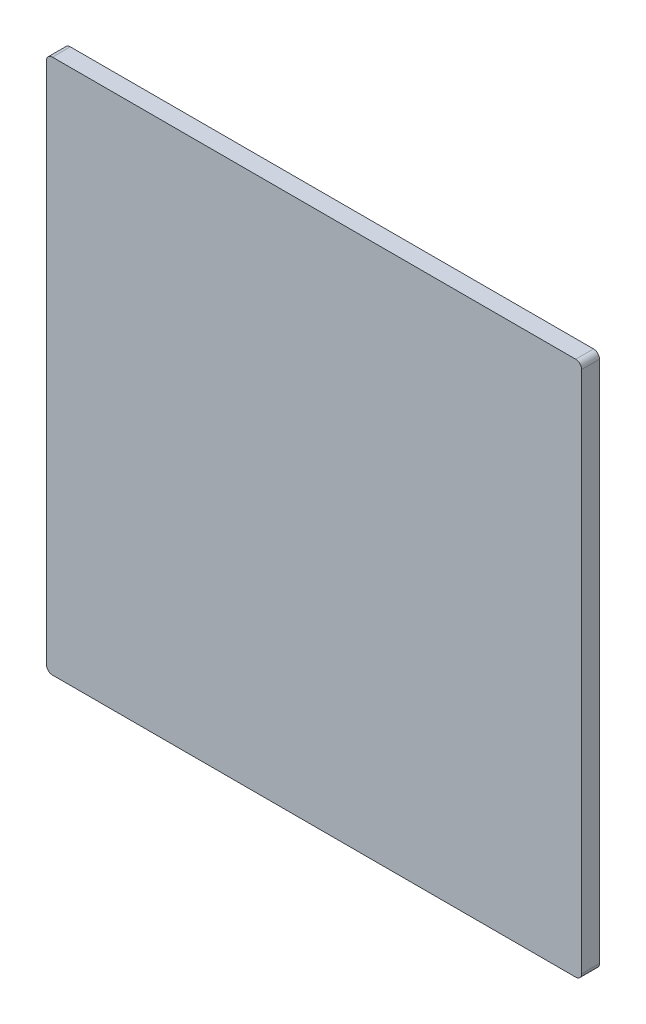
from build123d import *

# Parameters (mm, degrees)
SKETCH1_W           = 228.6
SKETCH1_H           = 228.6
BOSS_EXTRUDE1_DEPTH = 7.62
FILLET1_R           = 2.54


with BuildPart() as part:
    # Sketch1 → Boss-Extrude1 (new body)
    with BuildSketch(Plane.XY):
        Rectangle(SKETCH1_W, SKETCH1_H)
    extrude(amount=BOSS_EXTRUDE1_DEPTH)

    # Fillet1
    fillet1_edges = [part.edges().sort_by_distance(p)[0] for p in [
        (114.3, -114.3, 3.81),
        (-114.3, -114.3, 3.81),
        (-114.3, 114.3, 3.81),
        (114.3, 114.3, 3.81),
    ]]
    fillet(fillet1_edges, radius=FILLET1_R)


solid = part.part
